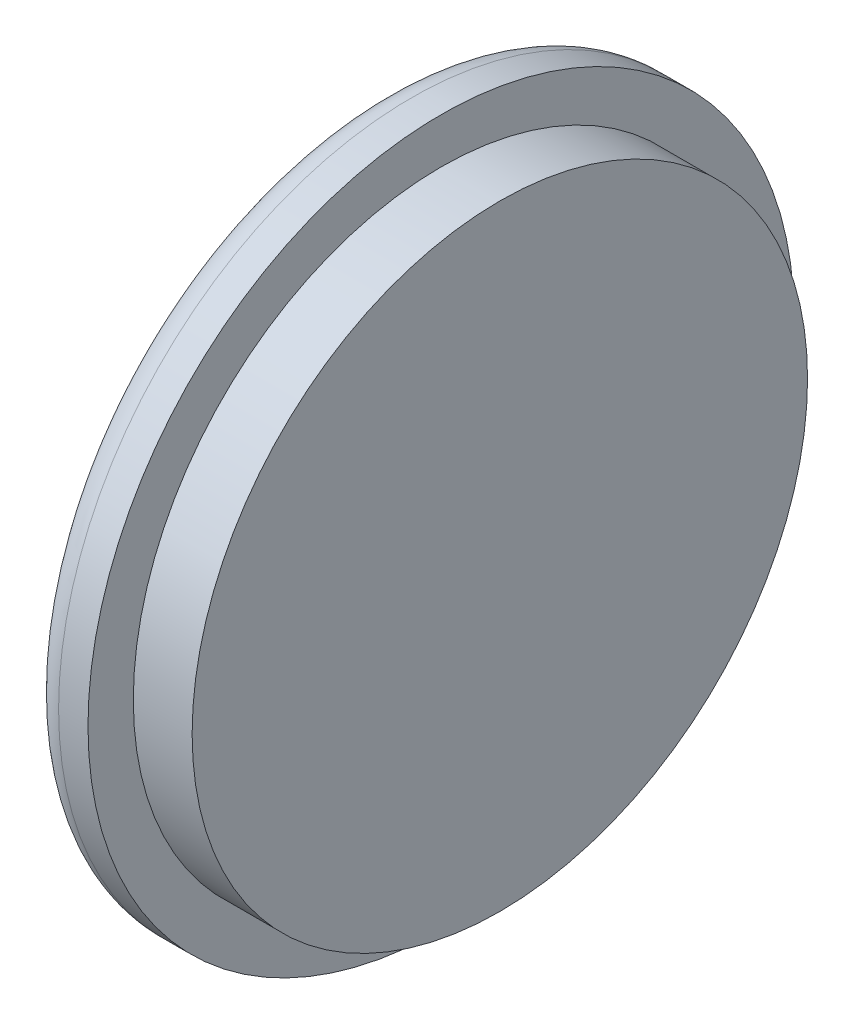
ISO-10303-21;
HEADER;
FILE_DESCRIPTION(('STEP AP214'),'2;1');
FILE_NAME('part.step','',(''),(''),'','','');
FILE_SCHEMA(('AUTOMOTIVE_DESIGN { 1 0 10303 214 1 1 1 1 }'));
ENDSEC;
DATA;
#1=APPLICATION_CONTEXT('core data for automotive mechanical design processes');
#2=APPLICATION_PROTOCOL_DEFINITION('international standard','automotive_design',2000,#1);
#3=PRODUCT_CONTEXT('',#1,'mechanical');
#4=PRODUCT('Part','Part','',(#3));
#5=PRODUCT_RELATED_PRODUCT_CATEGORY('part','',(#4));
#6=PRODUCT_DEFINITION_FORMATION('','',#4);
#7=PRODUCT_DEFINITION_CONTEXT('part definition',#1,'design');
#8=PRODUCT_DEFINITION('design','',#6,#7);
#9=PRODUCT_DEFINITION_SHAPE('','',#8);
#10=(LENGTH_UNIT() NAMED_UNIT(*) SI_UNIT(.MILLI.,.METRE.));
#11=(NAMED_UNIT(*) PLANE_ANGLE_UNIT() SI_UNIT($,.RADIAN.));
#12=(NAMED_UNIT(*) SI_UNIT($,.STERADIAN.) SOLID_ANGLE_UNIT());
#13=UNCERTAINTY_MEASURE_WITH_UNIT(LENGTH_MEASURE(1.E-05),#10,'distance_accuracy_value','');
#14=(GEOMETRIC_REPRESENTATION_CONTEXT(3) GLOBAL_UNCERTAINTY_ASSIGNED_CONTEXT((#13)) GLOBAL_UNIT_ASSIGNED_CONTEXT((#10,
#11,#12)) REPRESENTATION_CONTEXT('',''));
#15=CARTESIAN_POINT('',(0.,0.,0.));
#16=DIRECTION('',(0.,0.,1.));
#17=DIRECTION('',(1.,0.,0.));
#18=AXIS2_PLACEMENT_3D('',#15,#16,#17);
#19=CARTESIAN_POINT('',(0.,0.,0.));
#20=DIRECTION('',(1.,0.,0.));
#21=DIRECTION('',(0.,0.,-1.));
#22=AXIS2_PLACEMENT_3D('',#19,#20,#21);
#23=PLANE('',#22);
#24=CARTESIAN_POINT('',(0.,0.,0.));
#25=DIRECTION('',(1.,0.,0.));
#26=DIRECTION('',(0.,0.,-1.));
#27=AXIS2_PLACEMENT_3D('',#24,#25,#26);
#28=CIRCLE('',#27,34.925);
#29=CARTESIAN_POINT('',(0.,0.,-34.925));
#30=VERTEX_POINT('',#29);
#31=EDGE_CURVE('E41',#30,#30,#28,.F.);
#32=ORIENTED_EDGE('',*,*,#31,.T.);
#33=EDGE_LOOP('',(#32));
#34=FACE_BOUND('',#33,.T.);
#35=ADVANCED_FACE('F34',(#34),#23,.F.);
#36=CARTESIAN_POINT('',(0.,0.,0.));
#37=DIRECTION('',(-1.,0.,0.));
#38=DIRECTION('',(0.,0.,1.));
#39=AXIS2_PLACEMENT_3D('',#36,#37,#38);
#40=CYLINDRICAL_SURFACE('',#39,38.1);
#41=CARTESIAN_POINT('',(3.175,0.,0.));
#42=DIRECTION('',(1.,0.,0.));
#43=DIRECTION('',(0.,0.,-1.));
#44=AXIS2_PLACEMENT_3D('',#41,#42,#43);
#45=CIRCLE('',#44,38.1);
#46=CARTESIAN_POINT('',(3.175,0.,-38.1));
#47=VERTEX_POINT('',#46);
#48=EDGE_CURVE('E10',#47,#47,#45,.T.);
#49=ORIENTED_EDGE('',*,*,#48,.T.);
#50=EDGE_LOOP('',(#49));
#51=FACE_BOUND('',#50,.T.);
#52=CARTESIAN_POINT('',(6.34999999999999,0.,0.));
#53=DIRECTION('',(-1.,0.,0.));
#54=DIRECTION('',(0.,0.,1.));
#55=AXIS2_PLACEMENT_3D('',#52,#53,#54);
#56=CIRCLE('',#55,38.1);
#57=CARTESIAN_POINT('',(6.34999999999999,0.,38.1));
#58=VERTEX_POINT('',#57);
#59=EDGE_CURVE('E45',#58,#58,#56,.T.);
#60=ORIENTED_EDGE('',*,*,#59,.T.);
#61=EDGE_LOOP('',(#60));
#62=FACE_BOUND('',#61,.T.);
#63=ADVANCED_FACE('F72',(#51,#62),#40,.T.);
#64=CARTESIAN_POINT('',(6.35,33.2105,0.));
#65=DIRECTION('',(-1.,0.,0.));
#66=DIRECTION('',(0.,0.,1.));
#67=AXIS2_PLACEMENT_3D('',#64,#65,#66);
#68=PLANE('',#67);
#69=ORIENTED_EDGE('',*,*,#59,.F.);
#70=EDGE_LOOP('',(#69));
#71=FACE_BOUND('',#70,.T.);
#72=CARTESIAN_POINT('',(6.35,0.,0.));
#73=DIRECTION('',(-1.,0.,0.));
#74=DIRECTION('',(0.,0.,1.));
#75=AXIS2_PLACEMENT_3D('',#72,#73,#74);
#76=CIRCLE('',#75,33.2105);
#77=CARTESIAN_POINT('',(6.35,0.,33.2105));
#78=VERTEX_POINT('',#77);
#79=EDGE_CURVE('E49',#78,#78,#76,.T.);
#80=ORIENTED_EDGE('',*,*,#79,.T.);
#81=EDGE_LOOP('',(#80));
#82=FACE_BOUND('',#81,.T.);
#83=ADVANCED_FACE('F68',(#71,#82),#68,.F.);
#84=CARTESIAN_POINT('',(0.,0.,0.));
#85=DIRECTION('',(-1.,0.,0.));
#86=DIRECTION('',(0.,0.,1.));
#87=AXIS2_PLACEMENT_3D('',#84,#85,#86);
#88=CYLINDRICAL_SURFACE('',#87,33.2105);
#89=ORIENTED_EDGE('',*,*,#79,.F.);
#90=EDGE_LOOP('',(#89));
#91=FACE_BOUND('',#90,.T.);
#92=CARTESIAN_POINT('',(12.7,0.,0.));
#93=DIRECTION('',(-1.,0.,0.));
#94=DIRECTION('',(0.,0.,1.));
#95=AXIS2_PLACEMENT_3D('',#92,#93,#94);
#96=CIRCLE('',#95,33.2105);
#97=CARTESIAN_POINT('',(12.7,0.,33.2105));
#98=VERTEX_POINT('',#97);
#99=EDGE_CURVE('E54',#98,#98,#96,.T.);
#100=ORIENTED_EDGE('',*,*,#99,.T.);
#101=EDGE_LOOP('',(#100));
#102=FACE_BOUND('',#101,.T.);
#103=ADVANCED_FACE('F58',(#91,#102),#88,.T.);
#104=CARTESIAN_POINT('',(12.7,0.,0.));
#105=DIRECTION('',(-1.,0.,0.));
#106=DIRECTION('',(0.,0.,1.));
#107=AXIS2_PLACEMENT_3D('',#104,#105,#106);
#108=PLANE('',#107);
#109=ORIENTED_EDGE('',*,*,#99,.F.);
#110=EDGE_LOOP('',(#109));
#111=FACE_BOUND('',#110,.T.);
#112=ADVANCED_FACE('F60',(#111),#108,.F.);
#113=CARTESIAN_POINT('',(3.175,0.,0.));
#114=DIRECTION('',(1.,0.,0.));
#115=DIRECTION('',(0.,0.,-1.));
#116=AXIS2_PLACEMENT_3D('',#113,#114,#115);
#117=TOROIDAL_SURFACE('',#116,34.925,3.175);
#118=ORIENTED_EDGE('',*,*,#48,.F.);
#119=EDGE_LOOP('',(#118));
#120=FACE_BOUND('',#119,.T.);
#121=ORIENTED_EDGE('',*,*,#31,.F.);
#122=EDGE_LOOP('',(#121));
#123=FACE_BOUND('',#122,.T.);
#124=ADVANCED_FACE('F36',(#120,#123),#117,.T.);
#125=CLOSED_SHELL('',(#35,#63,#83,#103,#112,#124));
#126=MANIFOLD_SOLID_BREP('B2',#125);
#127=ADVANCED_BREP_SHAPE_REPRESENTATION('',(#18,#126),#14);
#128=SHAPE_DEFINITION_REPRESENTATION(#9,#127);
ENDSEC;
END-ISO-10303-21;
